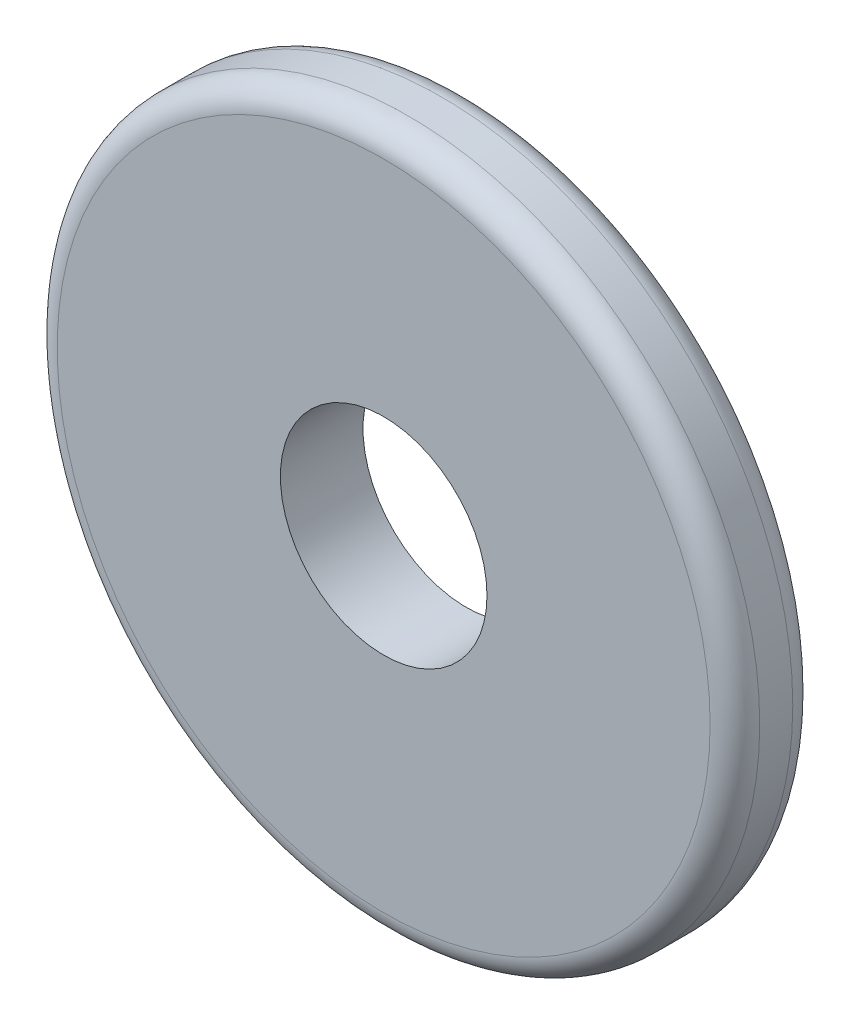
from build123d import *

# Parameters (mm, degrees)
SKETCH1_R           = 42.5
SKETCH1_R_2         = 12.5
BOSS_EXTRUDE1_DEPTH = 10
FILLET1_R           = 3


with BuildPart() as part:
    # Sketch1 → Boss-Extrude1 (new body)
    with BuildSketch(Plane.XY):
        Circle(SKETCH1_R)
        Circle(SKETCH1_R_2, mode=Mode.SUBTRACT)
    extrude(amount=BOSS_EXTRUDE1_DEPTH)

    # Fillet1
    fillet1_edges = [part.edges().sort_by_distance(p)[0] for p in [
        (-42.5, 0, 0),
        (-42.5, 0, 10),
    ]]
    fillet(fillet1_edges, radius=FILLET1_R)


solid = part.part
